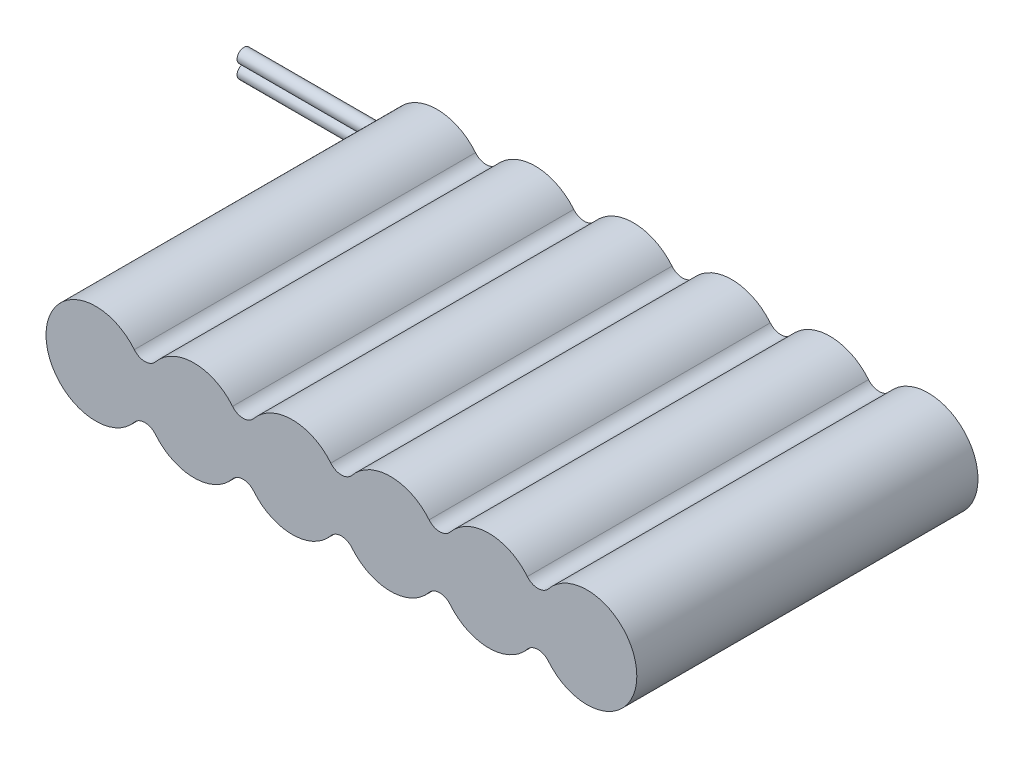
from build123d import *

# Parameters (mm, degrees)
BOSS_EXTRUDE4_DEPTH = 63.5
FILLET1_R           = 2.54
BOSS_EXTRUDE5_DEPTH = 25.4


with BuildPart() as part:
    # Sketch1 → Boss-Extrude4 (new body)
    with BuildSketch(Plane.XY):
        with BuildLine():
            ThreePointArc((9.144, 1.463755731), (-9.260416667, 0), (9.144, -1.463755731))
            ThreePointArc((9.144, -1.463755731), (18.288, -9.260416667), (27.432, -1.463755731))
            ThreePointArc((27.432, -1.463755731), (36.576, -9.260416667), (45.72, -1.463755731))
            ThreePointArc((45.72, -1.463755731), (54.864, -9.260416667), (64.008, -1.463755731))
            ThreePointArc((64.008, -1.463755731), (73.152, -9.260416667), (82.296, -1.463755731))
            ThreePointArc((82.296, -1.463755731), (100.700416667, 0), (82.296, 1.463755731))
            ThreePointArc((82.296, 1.463755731), (73.152, 9.260416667), (64.008, 1.463755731))
            ThreePointArc((64.008, 1.463755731), (54.864, 9.260416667), (45.72, 1.463755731))
            ThreePointArc((45.72, 1.463755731), (36.576, 9.260416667), (27.432, 1.463755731))
            ThreePointArc((27.432, 1.463755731), (18.288, 9.260416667), (9.144, 1.463755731))
        make_face()
    extrude(amount=BOSS_EXTRUDE4_DEPTH)

    # Fillet1
    fillet1_edges = [part.edges().sort_by_distance(p)[0] for p in [
        (64.008, 1.463755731, 31.75),
        (64.008, -1.463755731, 31.75),
        (45.72, 1.463755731, 31.75),
        (45.72, -1.463755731, 31.75),
        (27.432, 1.463755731, 31.75),
        (27.432, -1.463755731, 31.75),
        (9.144, 1.463755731, 31.75),
        (9.144, -1.463755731, 31.75),
        (82.296, -1.463755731, 31.75),
        (82.296, 1.463755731, 31.75),
    ]]
    fillet(fillet1_edges, radius=FILLET1_R)


with BuildPart() as body_2:
    # Sketch2 → Boss-Extrude5 (new body)
    with BuildSketch(Plane.ZY.offset(9.260416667)):
        with BuildLine():
            Line((1.120363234, 0.008846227), (1.120363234, -0.008846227))
            ThreePointArc((1.120363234, -0.008846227), (1.27, -2.54), (1.419636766, -0.008846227))
            Line((1.419636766, -0.008846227), (1.419636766, 0.008846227))
            ThreePointArc((1.419636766, 0.008846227), (1.27, 2.54), (1.120363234, 0.008846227))
        make_face()
    extrude(amount=BOSS_EXTRUDE5_DEPTH)


solid = Compound([part.part, body_2.part])
